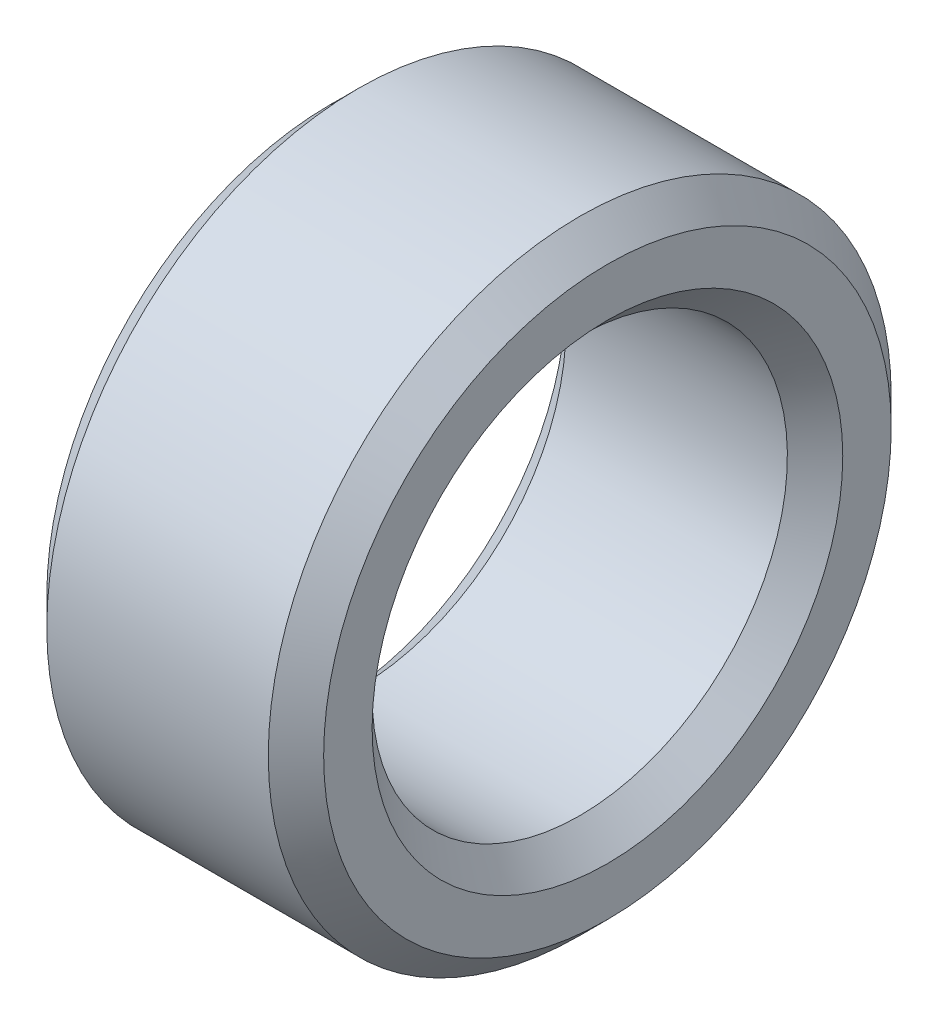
ISO-10303-21;
HEADER;
FILE_DESCRIPTION(('STEP AP214'),'2;1');
FILE_NAME('part.step','',(''),(''),'','','');
FILE_SCHEMA(('AUTOMOTIVE_DESIGN { 1 0 10303 214 1 1 1 1 }'));
ENDSEC;
DATA;
#1=APPLICATION_CONTEXT('core data for automotive mechanical design processes');
#2=APPLICATION_PROTOCOL_DEFINITION('international standard','automotive_design',2000,#1);
#3=PRODUCT_CONTEXT('',#1,'mechanical');
#4=PRODUCT('Part','Part','',(#3));
#5=PRODUCT_RELATED_PRODUCT_CATEGORY('part','',(#4));
#6=PRODUCT_DEFINITION_FORMATION('','',#4);
#7=PRODUCT_DEFINITION_CONTEXT('part definition',#1,'design');
#8=PRODUCT_DEFINITION('design','',#6,#7);
#9=PRODUCT_DEFINITION_SHAPE('','',#8);
#10=(LENGTH_UNIT() NAMED_UNIT(*) SI_UNIT(.MILLI.,.METRE.));
#11=(NAMED_UNIT(*) PLANE_ANGLE_UNIT() SI_UNIT($,.RADIAN.));
#12=(NAMED_UNIT(*) SI_UNIT($,.STERADIAN.) SOLID_ANGLE_UNIT());
#13=UNCERTAINTY_MEASURE_WITH_UNIT(LENGTH_MEASURE(1.E-05),#10,'distance_accuracy_value','');
#14=(GEOMETRIC_REPRESENTATION_CONTEXT(3) GLOBAL_UNCERTAINTY_ASSIGNED_CONTEXT((#13)) GLOBAL_UNIT_ASSIGNED_CONTEXT((#10,
#11,#12)) REPRESENTATION_CONTEXT('',''));
#15=CARTESIAN_POINT('',(0.,0.,0.));
#16=DIRECTION('',(0.,0.,1.));
#17=DIRECTION('',(1.,0.,0.));
#18=AXIS2_PLACEMENT_3D('',#15,#16,#17);
#19=CARTESIAN_POINT('',(0.,-3.75,0.));
#20=DIRECTION('',(-1.,0.,0.));
#21=DIRECTION('',(0.,1.,0.));
#22=AXIS2_PLACEMENT_3D('',#19,#20,#21);
#23=PLANE('',#22);
#24=CARTESIAN_POINT('',(0.,0.,0.));
#25=DIRECTION('',(1.,0.,0.));
#26=DIRECTION('',(0.,-1.,0.));
#27=AXIS2_PLACEMENT_3D('',#24,#25,#26);
#28=CIRCLE('',#27,3.4);
#29=CARTESIAN_POINT('',(0.,-3.4,0.));
#30=VERTEX_POINT('',#29);
#31=EDGE_CURVE('E9',#30,#30,#28,.T.);
#32=ORIENTED_EDGE('',*,*,#31,.T.);
#33=EDGE_LOOP('',(#32));
#34=FACE_BOUND('',#33,.T.);
#35=CARTESIAN_POINT('',(0.,0.,0.));
#36=DIRECTION('',(1.,0.,0.));
#37=DIRECTION('',(0.,-1.,0.));
#38=AXIS2_PLACEMENT_3D('',#35,#36,#37);
#39=CIRCLE('',#38,4.1);
#40=CARTESIAN_POINT('',(0.,-4.1,0.));
#41=VERTEX_POINT('',#40);
#42=EDGE_CURVE('E54',#41,#41,#39,.T.);
#43=ORIENTED_EDGE('',*,*,#42,.F.);
#44=EDGE_LOOP('',(#43));
#45=FACE_BOUND('',#44,.T.);
#46=ADVANCED_FACE('F15',(#34,#45),#23,.T.);
#47=CARTESIAN_POINT('',(0.2,0.,0.));
#48=DIRECTION('',(-1.,0.,0.));
#49=DIRECTION('',(0.,-1.,0.));
#50=AXIS2_PLACEMENT_3D('',#47,#48,#49);
#51=CONICAL_SURFACE('',#50,3.2,0.785398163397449);
#52=CARTESIAN_POINT('',(0.4,0.,0.));
#53=DIRECTION('',(1.,0.,0.));
#54=DIRECTION('',(0.,-1.,0.));
#55=AXIS2_PLACEMENT_3D('',#52,#53,#54);
#56=CIRCLE('',#55,3.);
#57=CARTESIAN_POINT('',(0.4,-3.,0.));
#58=VERTEX_POINT('',#57);
#59=EDGE_CURVE('E25',#58,#58,#56,.T.);
#60=ORIENTED_EDGE('',*,*,#59,.T.);
#61=EDGE_LOOP('',(#60));
#62=FACE_BOUND('',#61,.T.);
#63=ORIENTED_EDGE('',*,*,#31,.F.);
#64=EDGE_LOOP('',(#63));
#65=FACE_BOUND('',#64,.T.);
#66=ADVANCED_FACE('F81',(#62,#65),#51,.F.);
#67=CARTESIAN_POINT('',(2.,0.,0.));
#68=DIRECTION('',(-1.,0.,0.));
#69=DIRECTION('',(0.,-1.,0.));
#70=AXIS2_PLACEMENT_3D('',#67,#68,#69);
#71=CYLINDRICAL_SURFACE('',#70,3.);
#72=CARTESIAN_POINT('',(3.6,0.,0.));
#73=DIRECTION('',(1.,0.,0.));
#74=DIRECTION('',(0.,-1.,0.));
#75=AXIS2_PLACEMENT_3D('',#72,#73,#74);
#76=CIRCLE('',#75,3.);
#77=CARTESIAN_POINT('',(3.6,-3.,0.));
#78=VERTEX_POINT('',#77);
#79=EDGE_CURVE('E64',#78,#78,#76,.T.);
#80=ORIENTED_EDGE('',*,*,#79,.T.);
#81=EDGE_LOOP('',(#80));
#82=FACE_BOUND('',#81,.T.);
#83=ORIENTED_EDGE('',*,*,#59,.F.);
#84=EDGE_LOOP('',(#83));
#85=FACE_BOUND('',#84,.T.);
#86=ADVANCED_FACE('F68',(#82,#85),#71,.F.);
#87=CARTESIAN_POINT('',(3.8,0.,0.));
#88=DIRECTION('',(1.,0.,0.));
#89=DIRECTION('',(0.,-1.,0.));
#90=AXIS2_PLACEMENT_3D('',#87,#88,#89);
#91=CONICAL_SURFACE('',#90,3.2,0.78539816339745);
#92=CARTESIAN_POINT('',(4.,0.,0.));
#93=DIRECTION('',(1.,0.,0.));
#94=DIRECTION('',(0.,-1.,0.));
#95=AXIS2_PLACEMENT_3D('',#92,#93,#94);
#96=CIRCLE('',#95,3.4);
#97=CARTESIAN_POINT('',(4.,-3.4,0.));
#98=VERTEX_POINT('',#97);
#99=EDGE_CURVE('E38',#98,#98,#96,.T.);
#100=ORIENTED_EDGE('',*,*,#99,.T.);
#101=EDGE_LOOP('',(#100));
#102=FACE_BOUND('',#101,.T.);
#103=ORIENTED_EDGE('',*,*,#79,.F.);
#104=EDGE_LOOP('',(#103));
#105=FACE_BOUND('',#104,.T.);
#106=ADVANCED_FACE('F71',(#102,#105),#91,.F.);
#107=CARTESIAN_POINT('',(4.,-3.75,0.));
#108=DIRECTION('',(1.,0.,0.));
#109=DIRECTION('',(0.,-1.,0.));
#110=AXIS2_PLACEMENT_3D('',#107,#108,#109);
#111=PLANE('',#110);
#112=CARTESIAN_POINT('',(4.,0.,0.));
#113=DIRECTION('',(1.,0.,0.));
#114=DIRECTION('',(0.,-1.,0.));
#115=AXIS2_PLACEMENT_3D('',#112,#113,#114);
#116=CIRCLE('',#115,4.1);
#117=CARTESIAN_POINT('',(4.,-4.1,0.));
#118=VERTEX_POINT('',#117);
#119=EDGE_CURVE('E19',#118,#118,#116,.T.);
#120=ORIENTED_EDGE('',*,*,#119,.T.);
#121=EDGE_LOOP('',(#120));
#122=FACE_BOUND('',#121,.T.);
#123=ORIENTED_EDGE('',*,*,#99,.F.);
#124=EDGE_LOOP('',(#123));
#125=FACE_BOUND('',#124,.T.);
#126=ADVANCED_FACE('F73',(#122,#125),#111,.T.);
#127=CARTESIAN_POINT('',(3.8,0.,0.));
#128=DIRECTION('',(-1.,0.,0.));
#129=DIRECTION('',(0.,-1.,0.));
#130=AXIS2_PLACEMENT_3D('',#127,#128,#129);
#131=CONICAL_SURFACE('',#130,4.3,0.785398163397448);
#132=CARTESIAN_POINT('',(3.6,0.,0.));
#133=DIRECTION('',(1.,0.,0.));
#134=DIRECTION('',(0.,-1.,0.));
#135=AXIS2_PLACEMENT_3D('',#132,#133,#134);
#136=CIRCLE('',#135,4.5);
#137=CARTESIAN_POINT('',(3.6,-4.5,0.));
#138=VERTEX_POINT('',#137);
#139=EDGE_CURVE('E57',#138,#138,#136,.T.);
#140=ORIENTED_EDGE('',*,*,#139,.T.);
#141=EDGE_LOOP('',(#140));
#142=FACE_BOUND('',#141,.T.);
#143=ORIENTED_EDGE('',*,*,#119,.F.);
#144=EDGE_LOOP('',(#143));
#145=FACE_BOUND('',#144,.T.);
#146=ADVANCED_FACE('F79',(#142,#145),#131,.T.);
#147=CARTESIAN_POINT('',(2.,0.,0.));
#148=DIRECTION('',(-1.,0.,0.));
#149=DIRECTION('',(0.,-1.,0.));
#150=AXIS2_PLACEMENT_3D('',#147,#148,#149);
#151=CYLINDRICAL_SURFACE('',#150,4.5);
#152=CARTESIAN_POINT('',(0.4,0.,0.));
#153=DIRECTION('',(1.,0.,0.));
#154=DIRECTION('',(0.,-1.,0.));
#155=AXIS2_PLACEMENT_3D('',#152,#153,#154);
#156=CIRCLE('',#155,4.5);
#157=CARTESIAN_POINT('',(0.4,-4.5,0.));
#158=VERTEX_POINT('',#157);
#159=EDGE_CURVE('E58',#158,#158,#156,.T.);
#160=ORIENTED_EDGE('',*,*,#159,.T.);
#161=EDGE_LOOP('',(#160));
#162=FACE_BOUND('',#161,.T.);
#163=ORIENTED_EDGE('',*,*,#139,.F.);
#164=EDGE_LOOP('',(#163));
#165=FACE_BOUND('',#164,.T.);
#166=ADVANCED_FACE('F93',(#162,#165),#151,.T.);
#167=CARTESIAN_POINT('',(0.2,0.,0.));
#168=DIRECTION('',(1.,0.,0.));
#169=DIRECTION('',(0.,-1.,0.));
#170=AXIS2_PLACEMENT_3D('',#167,#168,#169);
#171=CONICAL_SURFACE('',#170,4.3,0.785398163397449);
#172=ORIENTED_EDGE('',*,*,#42,.T.);
#173=EDGE_LOOP('',(#172));
#174=FACE_BOUND('',#173,.T.);
#175=ORIENTED_EDGE('',*,*,#159,.F.);
#176=EDGE_LOOP('',(#175));
#177=FACE_BOUND('',#176,.T.);
#178=ADVANCED_FACE('F17',(#174,#177),#171,.T.);
#179=CLOSED_SHELL('',(#46,#66,#86,#106,#126,#146,#166,#178));
#180=MANIFOLD_SOLID_BREP('B1',#179);
#181=ADVANCED_BREP_SHAPE_REPRESENTATION('',(#18,#180),#14);
#182=SHAPE_DEFINITION_REPRESENTATION(#9,#181);
ENDSEC;
END-ISO-10303-21;
